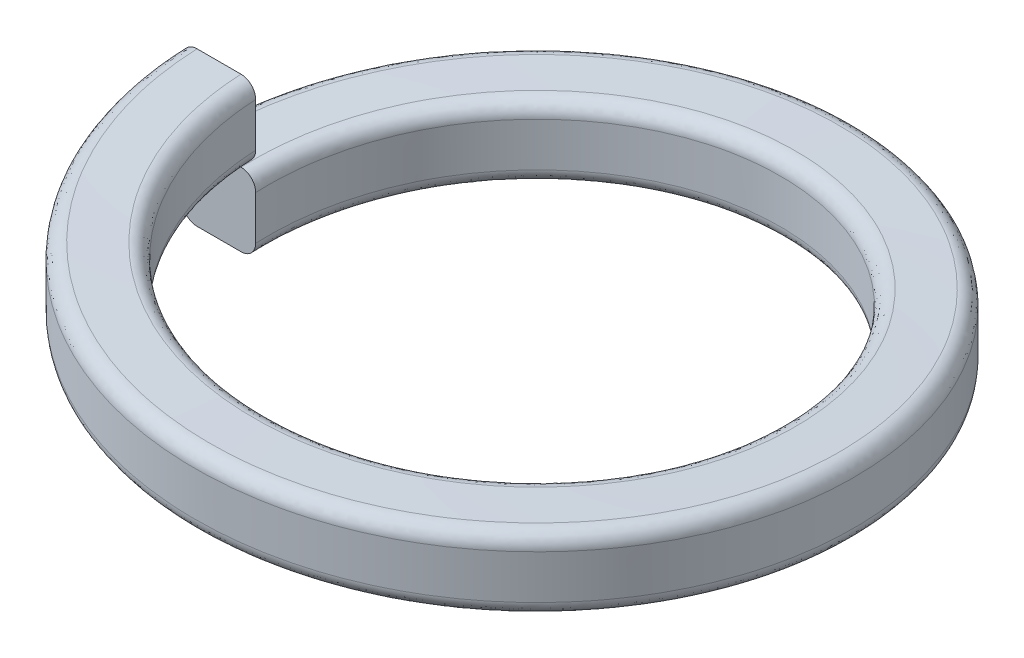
from build123d import *

# Parameters (mm, degrees)
SWEEP_1_PITCH       = 1.1
SWEEP_1_HEIGHT      = 1.1
SWEEP_1_RADIUS      = 4
SWEEP_1_START_ANGLE = -90
SKETCH_2_W          = 1
SKETCH_2_H          = 1
FILLET_1_R          = 0.2


with BuildPart() as part:
    # Sweep 1: sweep along a helix
    with BuildLine() as sweep_1_path:
        add(Helix(SWEEP_1_PITCH, SWEEP_1_HEIGHT, SWEEP_1_RADIUS, center=(0, 0, 0), direction=(0, 1, 0), lefthand=True, mode=Mode.PRIVATE).rotate(Axis((0, 0, 0), (0, 1, 0)), SWEEP_1_START_ANGLE))
    # Sketch 2 → Sweep 1 (sweep)
    with BuildSketch(Plane.XY):
        with Locations((-4, 0)):
            Rectangle(SKETCH_2_W, SKETCH_2_H)
    sweep(path=sweep_1_path.line, is_frenet=True)

    # Fillet 1
    fillet_1_edges = [part.edges().sort_by_distance(p)[0] for p in [
        (3.499996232, 1.05, 0),
        (4.499995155, 1.05, 0),
        (4.499995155, 0.05, 0),
        (3.499996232, 0.05, 0),
    ]]
    fillet(fillet_1_edges, radius=FILLET_1_R)


solid = part.part
